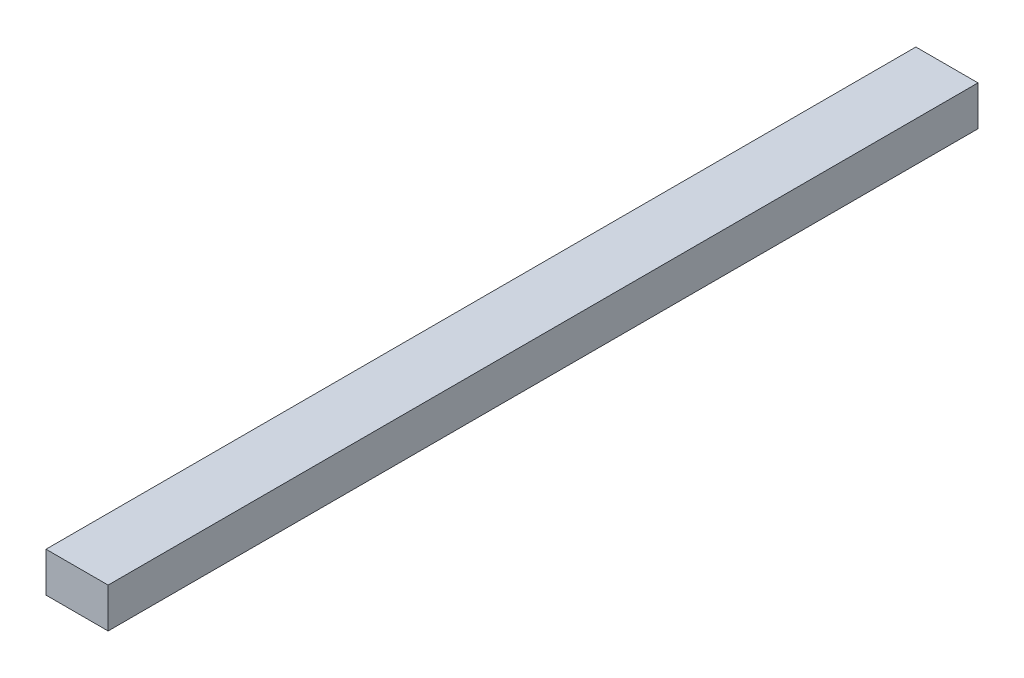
ISO-10303-21;
HEADER;
FILE_DESCRIPTION(('STEP AP214'),'2;1');
FILE_NAME('part.step','',(''),(''),'','','');
FILE_SCHEMA(('AUTOMOTIVE_DESIGN { 1 0 10303 214 1 1 1 1 }'));
ENDSEC;
DATA;
#1=APPLICATION_CONTEXT('core data for automotive mechanical design processes');
#2=APPLICATION_PROTOCOL_DEFINITION('international standard','automotive_design',2000,#1);
#3=PRODUCT_CONTEXT('',#1,'mechanical');
#4=PRODUCT('Part','Part','',(#3));
#5=PRODUCT_RELATED_PRODUCT_CATEGORY('part','',(#4));
#6=PRODUCT_DEFINITION_FORMATION('','',#4);
#7=PRODUCT_DEFINITION_CONTEXT('part definition',#1,'design');
#8=PRODUCT_DEFINITION('design','',#6,#7);
#9=PRODUCT_DEFINITION_SHAPE('','',#8);
#10=(LENGTH_UNIT() NAMED_UNIT(*) SI_UNIT(.MILLI.,.METRE.));
#11=(NAMED_UNIT(*) PLANE_ANGLE_UNIT() SI_UNIT($,.RADIAN.));
#12=(NAMED_UNIT(*) SI_UNIT($,.STERADIAN.) SOLID_ANGLE_UNIT());
#13=UNCERTAINTY_MEASURE_WITH_UNIT(LENGTH_MEASURE(1.E-05),#10,'distance_accuracy_value','');
#14=(GEOMETRIC_REPRESENTATION_CONTEXT(3) GLOBAL_UNCERTAINTY_ASSIGNED_CONTEXT((#13)) GLOBAL_UNIT_ASSIGNED_CONTEXT((#10,
#11,#12)) REPRESENTATION_CONTEXT('',''));
#15=CARTESIAN_POINT('',(0.,0.,0.));
#16=DIRECTION('',(0.,0.,1.));
#17=DIRECTION('',(1.,0.,0.));
#18=AXIS2_PLACEMENT_3D('',#15,#16,#17);
#19=CARTESIAN_POINT('',(-27.5,-17.5,-350.));
#20=DIRECTION('',(0.,0.,1.));
#21=DIRECTION('',(1.,0.,0.));
#22=AXIS2_PLACEMENT_3D('',#19,#20,#21);
#23=PLANE('',#22);
#24=DIRECTION('',(-1.,0.,0.));
#25=VECTOR('',#24,1.);
#26=CARTESIAN_POINT('',(25.,16.,-350.));
#27=LINE('',#26,#25);
#28=CARTESIAN_POINT('',(25.,16.,-350.));
#29=VERTEX_POINT('',#28);
#30=CARTESIAN_POINT('',(-25.,16.,-350.));
#31=VERTEX_POINT('',#30);
#32=EDGE_CURVE('E59',#29,#31,#27,.T.);
#33=ORIENTED_EDGE('',*,*,#32,.F.);
#34=DIRECTION('',(0.,1.,0.));
#35=VECTOR('',#34,1.);
#36=CARTESIAN_POINT('',(25.,-16.,-350.));
#37=LINE('',#36,#35);
#38=CARTESIAN_POINT('',(25.,-16.,-350.));
#39=VERTEX_POINT('',#38);
#40=EDGE_CURVE('E83',#39,#29,#37,.T.);
#41=ORIENTED_EDGE('',*,*,#40,.F.);
#42=DIRECTION('',(1.,0.,0.));
#43=VECTOR('',#42,1.);
#44=CARTESIAN_POINT('',(-25.,-16.,-350.));
#45=LINE('',#44,#43);
#46=CARTESIAN_POINT('',(-25.,-16.,-350.));
#47=VERTEX_POINT('',#46);
#48=EDGE_CURVE('E99',#47,#39,#45,.T.);
#49=ORIENTED_EDGE('',*,*,#48,.F.);
#50=DIRECTION('',(0.,-1.,0.));
#51=VECTOR('',#50,1.);
#52=CARTESIAN_POINT('',(-25.,16.,-350.));
#53=LINE('',#52,#51);
#54=EDGE_CURVE('E97',#31,#47,#53,.T.);
#55=ORIENTED_EDGE('',*,*,#54,.F.);
#56=EDGE_LOOP('',(#33,#41,#49,#55));
#57=FACE_BOUND('',#56,.T.);
#58=ADVANCED_FACE('F35',(#57),#23,.F.);
#59=CARTESIAN_POINT('',(25.,16.,-350.));
#60=DIRECTION('',(0.,1.,0.));
#61=DIRECTION('',(-1.,0.,0.));
#62=AXIS2_PLACEMENT_3D('',#59,#60,#61);
#63=PLANE('',#62);
#64=DIRECTION('',(0.,0.,1.));
#65=VECTOR('',#64,1.);
#66=CARTESIAN_POINT('',(25.,16.,-350.));
#67=LINE('',#66,#65);
#68=CARTESIAN_POINT('',(25.,16.,350.));
#69=VERTEX_POINT('',#68);
#70=EDGE_CURVE('E11',#29,#69,#67,.T.);
#71=ORIENTED_EDGE('',*,*,#70,.F.);
#72=ORIENTED_EDGE('',*,*,#32,.T.);
#73=DIRECTION('',(0.,0.,1.));
#74=VECTOR('',#73,1.);
#75=CARTESIAN_POINT('',(-25.,16.,-350.));
#76=LINE('',#75,#74);
#77=CARTESIAN_POINT('',(-25.,16.,350.));
#78=VERTEX_POINT('',#77);
#79=EDGE_CURVE('E38',#31,#78,#76,.T.);
#80=ORIENTED_EDGE('',*,*,#79,.T.);
#81=DIRECTION('',(-1.,0.,0.));
#82=VECTOR('',#81,1.);
#83=CARTESIAN_POINT('',(25.,16.,350.));
#84=LINE('',#83,#82);
#85=EDGE_CURVE('E77',#69,#78,#84,.T.);
#86=ORIENTED_EDGE('',*,*,#85,.F.);
#87=EDGE_LOOP('',(#71,#72,#80,#86));
#88=FACE_BOUND('',#87,.T.);
#89=ADVANCED_FACE('F75',(#88),#63,.T.);
#90=CARTESIAN_POINT('',(25.,-16.,-350.));
#91=DIRECTION('',(1.,0.,0.));
#92=DIRECTION('',(0.,1.,0.));
#93=AXIS2_PLACEMENT_3D('',#90,#91,#92);
#94=PLANE('',#93);
#95=DIRECTION('',(0.,0.,1.));
#96=VECTOR('',#95,1.);
#97=CARTESIAN_POINT('',(25.,-16.,-350.));
#98=LINE('',#97,#96);
#99=CARTESIAN_POINT('',(25.,-16.,350.));
#100=VERTEX_POINT('',#99);
#101=EDGE_CURVE('E43',#39,#100,#98,.T.);
#102=ORIENTED_EDGE('',*,*,#101,.F.);
#103=ORIENTED_EDGE('',*,*,#40,.T.);
#104=ORIENTED_EDGE('',*,*,#70,.T.);
#105=DIRECTION('',(0.,1.,0.));
#106=VECTOR('',#105,1.);
#107=CARTESIAN_POINT('',(25.,-16.,350.));
#108=LINE('',#107,#106);
#109=EDGE_CURVE('E91',#100,#69,#108,.T.);
#110=ORIENTED_EDGE('',*,*,#109,.F.);
#111=EDGE_LOOP('',(#102,#103,#104,#110));
#112=FACE_BOUND('',#111,.T.);
#113=ADVANCED_FACE('F108',(#112),#94,.T.);
#114=CARTESIAN_POINT('',(-25.,-16.,-350.));
#115=DIRECTION('',(0.,-1.,0.));
#116=DIRECTION('',(0.,0.,-1.));
#117=AXIS2_PLACEMENT_3D('',#114,#115,#116);
#118=PLANE('',#117);
#119=DIRECTION('',(0.,0.,1.));
#120=VECTOR('',#119,1.);
#121=CARTESIAN_POINT('',(-25.,-16.,-350.));
#122=LINE('',#121,#120);
#123=CARTESIAN_POINT('',(-25.,-16.,350.));
#124=VERTEX_POINT('',#123);
#125=EDGE_CURVE('E82',#47,#124,#122,.T.);
#126=ORIENTED_EDGE('',*,*,#125,.F.);
#127=ORIENTED_EDGE('',*,*,#48,.T.);
#128=ORIENTED_EDGE('',*,*,#101,.T.);
#129=DIRECTION('',(1.,0.,0.));
#130=VECTOR('',#129,1.);
#131=CARTESIAN_POINT('',(-25.,-16.,350.));
#132=LINE('',#131,#130);
#133=EDGE_CURVE('E51',#124,#100,#132,.T.);
#134=ORIENTED_EDGE('',*,*,#133,.F.);
#135=EDGE_LOOP('',(#126,#127,#128,#134));
#136=FACE_BOUND('',#135,.T.);
#137=ADVANCED_FACE('F104',(#136),#118,.T.);
#138=CARTESIAN_POINT('',(-25.,16.,-350.));
#139=DIRECTION('',(-1.,0.,0.));
#140=DIRECTION('',(0.,-1.,0.));
#141=AXIS2_PLACEMENT_3D('',#138,#139,#140);
#142=PLANE('',#141);
#143=ORIENTED_EDGE('',*,*,#79,.F.);
#144=ORIENTED_EDGE('',*,*,#54,.T.);
#145=ORIENTED_EDGE('',*,*,#125,.T.);
#146=DIRECTION('',(0.,-1.,0.));
#147=VECTOR('',#146,1.);
#148=CARTESIAN_POINT('',(-25.,16.,350.));
#149=LINE('',#148,#147);
#150=EDGE_CURVE('E85',#78,#124,#149,.T.);
#151=ORIENTED_EDGE('',*,*,#150,.F.);
#152=EDGE_LOOP('',(#143,#144,#145,#151));
#153=FACE_BOUND('',#152,.T.);
#154=ADVANCED_FACE('F86',(#153),#142,.T.);
#155=CARTESIAN_POINT('',(-27.5,-17.5,350.));
#156=DIRECTION('',(0.,0.,1.));
#157=DIRECTION('',(1.,0.,0.));
#158=AXIS2_PLACEMENT_3D('',#155,#156,#157);
#159=PLANE('',#158);
#160=ORIENTED_EDGE('',*,*,#109,.T.);
#161=ORIENTED_EDGE('',*,*,#85,.T.);
#162=ORIENTED_EDGE('',*,*,#150,.T.);
#163=ORIENTED_EDGE('',*,*,#133,.T.);
#164=EDGE_LOOP('',(#160,#161,#162,#163));
#165=FACE_BOUND('',#164,.T.);
#166=ADVANCED_FACE('F89',(#165),#159,.T.);
#167=CLOSED_SHELL('',(#58,#89,#113,#137,#154,#166));
#168=MANIFOLD_SOLID_BREP('B2',#167);
#169=ADVANCED_BREP_SHAPE_REPRESENTATION('',(#18,#168),#14);
#170=SHAPE_DEFINITION_REPRESENTATION(#9,#169);
ENDSEC;
END-ISO-10303-21;
